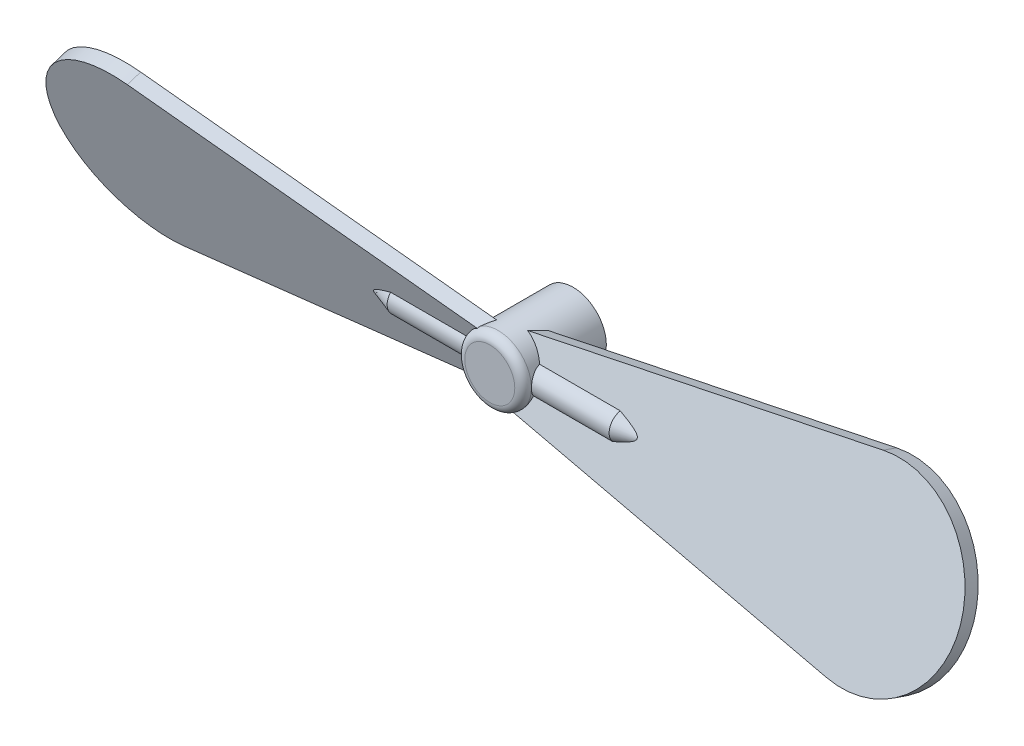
from build123d import *

# Parameters (mm, degrees)
EXTRUSION1_DEPTH             = 0.8
EXTRUSION1_DEPTH_BACK        = 2.2
ESQUISSE1_R                  = 1.2
CONG_2_R                     = 0.3
EXTRUSION2_DEPTH             = 0.25
R_P_TITION_CIRCULAIRE1_COUNT = 2
ESQUISSE4_R                  = 0.4
EXTRUSION3_DEPTH             = 2.2


with BuildPart() as part:
    # Esquisse1 → Extrusion1 (new, two sides: drawn at the far end of the back side and taken through both)
    with BuildSketch(Plane.XY.offset(-EXTRUSION1_DEPTH_BACK)):
        Circle(ESQUISSE1_R)
    extrude(amount=EXTRUSION1_DEPTH + EXTRUSION1_DEPTH_BACK)

    # Cong_2
    cong_2_edges = [part.edges().sort_by_distance(p)[0] for p in [
        (-1.2, 0, 0.8),
    ]]
    fillet(cong_2_edges, radius=CONG_2_R)

    # Esquisse2 → R_volution1 (revolve)
    with BuildSketch(Plane.XY, mode=Mode.PRIVATE) as r_volution1_sk:
        Polygon((0, 0.5), (4, 0.5), (5.5, 0), (0, 0), align=None)
    r_volution1 = revolve(r_volution1_sk.sketch.rotate(Axis((0, 0, 0), (1, 0, 0)), 180), axis=Axis((0, 0, 0), (1, 0, 0)))

    # Esquisse3 → Extrusion2 (add, symmetric)
    with BuildSketch(Plane(origin=(0, 0, 0), x_dir=(1, 0, 0), z_dir=(0, 0.320612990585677, 0.9472102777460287))):
        with BuildLine():
            Line((-0.171102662, -0.985253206), (12.59391635, -3.202072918))
            ThreePointArc((12.59391635, -3.202072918), (16.4, 0), (12.59391635, 3.202072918))
            Line((12.59391635, 3.202072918), (-0.171102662, 0.985253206))
            ThreePointArc((-0.171102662, 0.985253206), (-1, 0), (-0.171102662, -0.985253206))
        make_face()
    extrusion2 = extrude(amount=EXTRUSION2_DEPTH, both=True)

    # R_p_tition circulaire1: R_volution1, Extrusion2 ×2 about axis
    r_p_tition_circulaire1_axis = Axis((0, 0, 0), (0, 0, 1))
    add([r_volution1.rotate(r_p_tition_circulaire1_axis, i * 360 / R_P_TITION_CIRCULAIRE1_COUNT) for i in range(1, R_P_TITION_CIRCULAIRE1_COUNT)])
    add([extrusion2.rotate(r_p_tition_circulaire1_axis, i * 360 / R_P_TITION_CIRCULAIRE1_COUNT) for i in range(1, R_P_TITION_CIRCULAIRE1_COUNT)])

    # Esquisse4 → Extrusion3 (cut)
    with BuildSketch(Plane(origin=(0, 0, -2.2), x_dir=(-1, 0, 0), z_dir=(0, 0, -1))):
        Circle(ESQUISSE4_R)
    extrude(amount=-EXTRUSION3_DEPTH, mode=Mode.SUBTRACT)


solid = part.part
